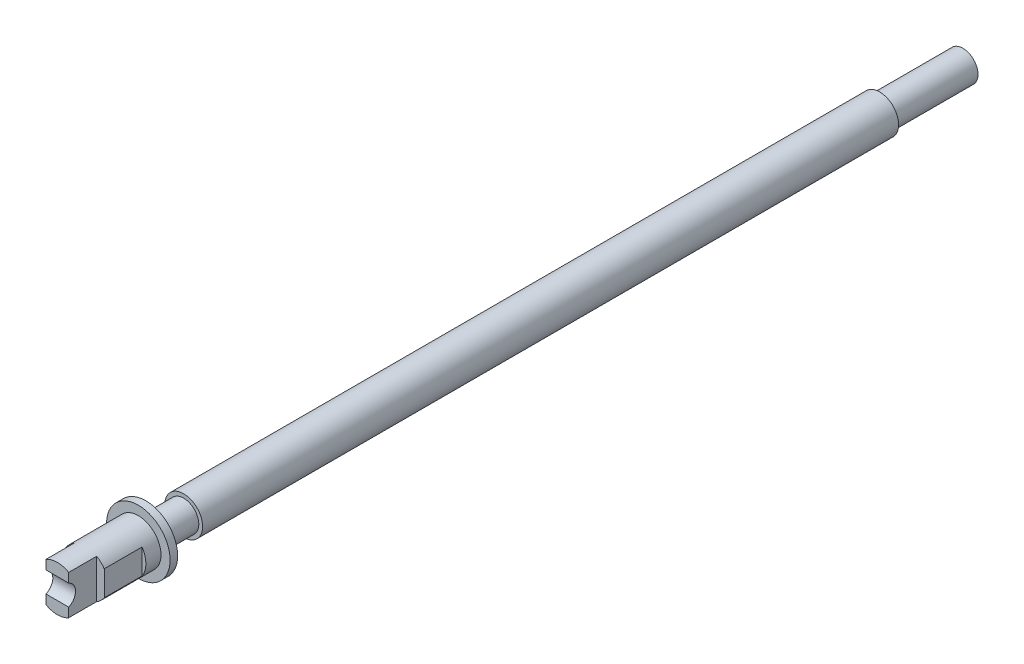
ISO-10303-21;
HEADER;
FILE_DESCRIPTION(('STEP AP214'),'2;1');
FILE_NAME('part.step','',(''),(''),'','','');
FILE_SCHEMA(('AUTOMOTIVE_DESIGN { 1 0 10303 214 1 1 1 1 }'));
ENDSEC;
DATA;
#1=APPLICATION_CONTEXT('core data for automotive mechanical design processes');
#2=APPLICATION_PROTOCOL_DEFINITION('international standard','automotive_design',2000,#1);
#3=PRODUCT_CONTEXT('',#1,'mechanical');
#4=PRODUCT('Part','Part','',(#3));
#5=PRODUCT_RELATED_PRODUCT_CATEGORY('part','',(#4));
#6=PRODUCT_DEFINITION_FORMATION('','',#4);
#7=PRODUCT_DEFINITION_CONTEXT('part definition',#1,'design');
#8=PRODUCT_DEFINITION('design','',#6,#7);
#9=PRODUCT_DEFINITION_SHAPE('','',#8);
#10=(LENGTH_UNIT() NAMED_UNIT(*) SI_UNIT(.MILLI.,.METRE.));
#11=(NAMED_UNIT(*) PLANE_ANGLE_UNIT() SI_UNIT($,.RADIAN.));
#12=(NAMED_UNIT(*) SI_UNIT($,.STERADIAN.) SOLID_ANGLE_UNIT());
#13=UNCERTAINTY_MEASURE_WITH_UNIT(LENGTH_MEASURE(1.E-05),#10,'distance_accuracy_value','');
#14=(GEOMETRIC_REPRESENTATION_CONTEXT(3) GLOBAL_UNCERTAINTY_ASSIGNED_CONTEXT((#13)) GLOBAL_UNIT_ASSIGNED_CONTEXT((#10,
#11,#12)) REPRESENTATION_CONTEXT('',''));
#15=CARTESIAN_POINT('',(0.,0.,0.));
#16=DIRECTION('',(0.,0.,1.));
#17=DIRECTION('',(1.,0.,0.));
#18=AXIS2_PLACEMENT_3D('',#15,#16,#17);
#19=CARTESIAN_POINT('',(0.,0.,143.7));
#20=DIRECTION('',(0.,0.,1.));
#21=DIRECTION('',(1.,0.,0.));
#22=AXIS2_PLACEMENT_3D('',#19,#20,#21);
#23=PLANE('',#22);
#24=DIRECTION('',(1.,0.,0.));
#25=VECTOR('',#24,1.);
#26=CARTESIAN_POINT('',(-7.5,-1.37477270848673,143.7));
#27=LINE('',#26,#25);
#28=CARTESIAN_POINT('',(-1.5,-1.37477270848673,143.7));
#29=VERTEX_POINT('',#28);
#30=CARTESIAN_POINT('',(1.5,-1.37477270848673,143.7));
#31=VERTEX_POINT('',#30);
#32=EDGE_CURVE('E57',#29,#31,#27,.T.);
#33=ORIENTED_EDGE('',*,*,#32,.F.);
#34=DIRECTION('',(0.,-1.,0.));
#35=VECTOR('',#34,1.);
#36=CARTESIAN_POINT('',(-1.5,0.,143.7));
#37=LINE('',#36,#35);
#38=CARTESIAN_POINT('',(-1.5,-2.59807621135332,143.7));
#39=VERTEX_POINT('',#38);
#40=EDGE_CURVE('E137',#29,#39,#37,.T.);
#41=ORIENTED_EDGE('',*,*,#40,.T.);
#42=CARTESIAN_POINT('',(0.,0.,143.7));
#43=DIRECTION('',(0.,0.,1.));
#44=DIRECTION('',(1.,0.,0.));
#45=AXIS2_PLACEMENT_3D('',#42,#43,#44);
#46=CIRCLE('',#45,3.);
#47=CARTESIAN_POINT('',(1.5,-2.59807621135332,143.7));
#48=VERTEX_POINT('',#47);
#49=EDGE_CURVE('E166',#39,#48,#46,.T.);
#50=ORIENTED_EDGE('',*,*,#49,.T.);
#51=DIRECTION('',(0.,-1.,0.));
#52=VECTOR('',#51,1.);
#53=CARTESIAN_POINT('',(1.5,0.,143.7));
#54=LINE('',#53,#52);
#55=EDGE_CURVE('E124',#31,#48,#54,.T.);
#56=ORIENTED_EDGE('',*,*,#55,.F.);
#57=EDGE_LOOP('',(#33,#41,#50,#56));
#58=FACE_BOUND('',#57,.T.);
#59=ADVANCED_FACE('F42',(#58),#23,.T.);
#60=CARTESIAN_POINT('',(0.,0.,35.));
#61=DIRECTION('',(0.,0.,-1.));
#62=DIRECTION('',(-1.,0.,0.));
#63=AXIS2_PLACEMENT_3D('',#60,#61,#62);
#64=CYLINDRICAL_SURFACE('',#63,2.);
#65=CARTESIAN_POINT('',(0.,0.,35.));
#66=DIRECTION('',(0.,0.,1.));
#67=DIRECTION('',(1.,0.,0.));
#68=AXIS2_PLACEMENT_3D('',#65,#66,#67);
#69=CIRCLE('',#68,2.);
#70=CARTESIAN_POINT('',(2.,0.,35.));
#71=VERTEX_POINT('',#70);
#72=EDGE_CURVE('E50',#71,#71,#69,.T.);
#73=ORIENTED_EDGE('',*,*,#72,.F.);
#74=EDGE_LOOP('',(#73));
#75=FACE_BOUND('',#74,.T.);
#76=CARTESIAN_POINT('',(0.,0.,24.));
#77=DIRECTION('',(0.,0.,-1.));
#78=DIRECTION('',(-1.,0.,0.));
#79=AXIS2_PLACEMENT_3D('',#76,#77,#78);
#80=CIRCLE('',#79,2.);
#81=CARTESIAN_POINT('',(-2.,0.,24.));
#82=VERTEX_POINT('',#81);
#83=EDGE_CURVE('E129',#82,#82,#80,.T.);
#84=ORIENTED_EDGE('',*,*,#83,.F.);
#85=EDGE_LOOP('',(#84));
#86=FACE_BOUND('',#85,.T.);
#87=ADVANCED_FACE('F44',(#75,#86),#64,.T.);
#88=CARTESIAN_POINT('',(2.5,0.,129.64589803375));
#89=DIRECTION('',(1.,0.,0.));
#90=DIRECTION('',(0.,0.,-1.));
#91=AXIS2_PLACEMENT_3D('',#88,#89,#90);
#92=PLANE('',#91);
#93=DIRECTION('',(0.,0.,1.));
#94=VECTOR('',#93,1.);
#95=CARTESIAN_POINT('',(2.5,1.6583123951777,129.64589803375));
#96=LINE('',#95,#94);
#97=CARTESIAN_POINT('',(2.5,1.6583123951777,135.));
#98=VERTEX_POINT('',#97);
#99=CARTESIAN_POINT('',(2.5,1.6583123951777,140.));
#100=VERTEX_POINT('',#99);
#101=EDGE_CURVE('E155',#98,#100,#96,.T.);
#102=ORIENTED_EDGE('',*,*,#101,.T.);
#103=DIRECTION('',(0.,1.,0.));
#104=VECTOR('',#103,1.);
#105=CARTESIAN_POINT('',(2.5,0.,140.));
#106=LINE('',#105,#104);
#107=CARTESIAN_POINT('',(2.5,-1.6583123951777,140.));
#108=VERTEX_POINT('',#107);
#109=EDGE_CURVE('E132',#108,#100,#106,.T.);
#110=ORIENTED_EDGE('',*,*,#109,.F.);
#111=DIRECTION('',(0.,0.,1.));
#112=VECTOR('',#111,1.);
#113=CARTESIAN_POINT('',(2.5,-1.6583123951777,129.64589803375));
#114=LINE('',#113,#112);
#115=CARTESIAN_POINT('',(2.5,-1.6583123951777,135.));
#116=VERTEX_POINT('',#115);
#117=EDGE_CURVE('E149',#116,#108,#114,.T.);
#118=ORIENTED_EDGE('',*,*,#117,.F.);
#119=DIRECTION('',(0.,-1.,0.));
#120=VECTOR('',#119,1.);
#121=CARTESIAN_POINT('',(2.5,0.,135.));
#122=LINE('',#121,#120);
#123=EDGE_CURVE('E152',#98,#116,#122,.T.);
#124=ORIENTED_EDGE('',*,*,#123,.F.);
#125=EDGE_LOOP('',(#102,#110,#118,#124));
#126=FACE_BOUND('',#125,.T.);
#127=ADVANCED_FACE('F200',(#126),#92,.T.);
#128=CARTESIAN_POINT('',(0.,0.,143.7));
#129=DIRECTION('',(0.,0.,-1.));
#130=DIRECTION('',(-1.,0.,0.));
#131=AXIS2_PLACEMENT_3D('',#128,#129,#130);
#132=CYLINDRICAL_SURFACE('',#131,3.);
#133=CARTESIAN_POINT('',(0.,0.,133.));
#134=DIRECTION('',(0.,0.,1.));
#135=DIRECTION('',(1.,0.,0.));
#136=AXIS2_PLACEMENT_3D('',#133,#134,#135);
#137=CIRCLE('',#136,3.);
#138=CARTESIAN_POINT('',(3.,0.,133.));
#139=VERTEX_POINT('',#138);
#140=EDGE_CURVE('E162',#139,#139,#137,.T.);
#141=ORIENTED_EDGE('',*,*,#140,.T.);
#142=EDGE_LOOP('',(#141));
#143=FACE_BOUND('',#142,.T.);
#144=CARTESIAN_POINT('',(1.5,2.59807621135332,143.7));
#145=VERTEX_POINT('',#144);
#146=CARTESIAN_POINT('',(-1.5,2.59807621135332,143.7));
#147=VERTEX_POINT('',#146);
#148=EDGE_CURVE('E163',#145,#147,#46,.T.);
#149=ORIENTED_EDGE('',*,*,#148,.F.);
#150=DIRECTION('',(0.,0.,1.));
#151=VECTOR('',#150,1.);
#152=CARTESIAN_POINT('',(1.5,2.59807621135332,140.));
#153=LINE('',#152,#151);
#154=CARTESIAN_POINT('',(1.5,2.59807621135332,140.));
#155=VERTEX_POINT('',#154);
#156=EDGE_CURVE('E122',#155,#145,#153,.T.);
#157=ORIENTED_EDGE('',*,*,#156,.F.);
#158=CARTESIAN_POINT('',(0.,0.,140.));
#159=DIRECTION('',(0.,0.,1.));
#160=DIRECTION('',(1.,0.,0.));
#161=AXIS2_PLACEMENT_3D('',#158,#159,#160);
#162=CIRCLE('',#161,3.);
#163=EDGE_CURVE('E123',#100,#155,#162,.T.);
#164=ORIENTED_EDGE('',*,*,#163,.F.);
#165=ORIENTED_EDGE('',*,*,#101,.F.);
#166=CARTESIAN_POINT('',(0.,0.,135.));
#167=DIRECTION('',(0.,0.,1.));
#168=DIRECTION('',(1.,0.,0.));
#169=AXIS2_PLACEMENT_3D('',#166,#167,#168);
#170=CIRCLE('',#169,3.);
#171=EDGE_CURVE('E154',#98,#116,#170,.F.);
#172=ORIENTED_EDGE('',*,*,#171,.T.);
#173=ORIENTED_EDGE('',*,*,#117,.T.);
#174=CARTESIAN_POINT('',(1.5,-2.59807621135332,140.));
#175=VERTEX_POINT('',#174);
#176=EDGE_CURVE('E64',#175,#108,#162,.T.);
#177=ORIENTED_EDGE('',*,*,#176,.F.);
#178=DIRECTION('',(0.,0.,1.));
#179=VECTOR('',#178,1.);
#180=CARTESIAN_POINT('',(1.5,-2.59807621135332,140.));
#181=LINE('',#180,#179);
#182=EDGE_CURVE('E134',#175,#48,#181,.T.);
#183=ORIENTED_EDGE('',*,*,#182,.T.);
#184=ORIENTED_EDGE('',*,*,#49,.F.);
#185=DIRECTION('',(0.,0.,1.));
#186=VECTOR('',#185,1.);
#187=CARTESIAN_POINT('',(-1.5,-2.59807621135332,140.));
#188=LINE('',#187,#186);
#189=CARTESIAN_POINT('',(-1.5,-2.59807621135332,140.));
#190=VERTEX_POINT('',#189);
#191=EDGE_CURVE('E146',#190,#39,#188,.T.);
#192=ORIENTED_EDGE('',*,*,#191,.F.);
#193=CARTESIAN_POINT('',(0.,0.,140.));
#194=DIRECTION('',(0.,0.,1.));
#195=DIRECTION('',(1.,0.,0.));
#196=AXIS2_PLACEMENT_3D('',#193,#194,#195);
#197=CIRCLE('',#196,3.);
#198=CARTESIAN_POINT('',(-1.5,2.59807621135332,140.));
#199=VERTEX_POINT('',#198);
#200=EDGE_CURVE('E141',#199,#190,#197,.T.);
#201=ORIENTED_EDGE('',*,*,#200,.F.);
#202=DIRECTION('',(0.,0.,1.));
#203=VECTOR('',#202,1.);
#204=CARTESIAN_POINT('',(-1.5,2.59807621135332,140.));
#205=LINE('',#204,#203);
#206=EDGE_CURVE('E144',#199,#147,#205,.T.);
#207=ORIENTED_EDGE('',*,*,#206,.T.);
#208=EDGE_LOOP('',(#149,#157,#164,#165,#172,#173,#177,#183,#184,#192,#201,#207));
#209=FACE_BOUND('',#208,.T.);
#210=ADVANCED_FACE('F199',(#143,#209),#132,.T.);
#211=DIRECTION('',(1.,0.,0.));
#212=VECTOR('',#211,1.);
#213=CARTESIAN_POINT('',(-7.5,1.37477270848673,143.7));
#214=LINE('',#213,#212);
#215=CARTESIAN_POINT('',(1.5,1.37477270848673,143.7));
#216=VERTEX_POINT('',#215);
#217=CARTESIAN_POINT('',(-1.5,1.37477270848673,143.7));
#218=VERTEX_POINT('',#217);
#219=EDGE_CURVE('E106',#216,#218,#214,.F.);
#220=ORIENTED_EDGE('',*,*,#219,.F.);
#221=EDGE_CURVE('E115',#145,#216,#54,.T.);
#222=ORIENTED_EDGE('',*,*,#221,.F.);
#223=ORIENTED_EDGE('',*,*,#148,.T.);
#224=EDGE_CURVE('E118',#147,#218,#37,.T.);
#225=ORIENTED_EDGE('',*,*,#224,.T.);
#226=EDGE_LOOP('',(#220,#222,#223,#225));
#227=FACE_BOUND('',#226,.T.);
#228=ADVANCED_FACE('F114',(#227),#23,.T.);
#229=CARTESIAN_POINT('',(0.,0.,133.));
#230=DIRECTION('',(0.,0.,1.));
#231=DIRECTION('',(1.,0.,0.));
#232=AXIS2_PLACEMENT_3D('',#229,#230,#231);
#233=PLANE('',#232);
#234=CARTESIAN_POINT('',(0.,0.,133.));
#235=DIRECTION('',(0.,0.,1.));
#236=DIRECTION('',(1.,0.,0.));
#237=AXIS2_PLACEMENT_3D('',#234,#235,#236);
#238=CIRCLE('',#237,4.2);
#239=CARTESIAN_POINT('',(4.2,0.,133.));
#240=VERTEX_POINT('',#239);
#241=EDGE_CURVE('E169',#240,#240,#238,.T.);
#242=ORIENTED_EDGE('',*,*,#241,.T.);
#243=EDGE_LOOP('',(#242));
#244=FACE_BOUND('',#243,.T.);
#245=ORIENTED_EDGE('',*,*,#140,.F.);
#246=EDGE_LOOP('',(#245));
#247=FACE_BOUND('',#246,.T.);
#248=ADVANCED_FACE('F232',(#244,#247),#233,.T.);
#249=CARTESIAN_POINT('',(0.,0.,127.));
#250=DIRECTION('',(0.,0.,1.));
#251=DIRECTION('',(1.,0.,0.));
#252=AXIS2_PLACEMENT_3D('',#249,#250,#251);
#253=PLANE('',#252);
#254=CARTESIAN_POINT('',(0.,0.,127.));
#255=DIRECTION('',(0.,0.,1.));
#256=DIRECTION('',(1.,0.,0.));
#257=AXIS2_PLACEMENT_3D('',#254,#255,#256);
#258=CIRCLE('',#257,2.5);
#259=CARTESIAN_POINT('',(2.5,0.,127.));
#260=VERTEX_POINT('',#259);
#261=EDGE_CURVE('E181',#260,#260,#258,.T.);
#262=ORIENTED_EDGE('',*,*,#261,.T.);
#263=EDGE_LOOP('',(#262));
#264=FACE_BOUND('',#263,.T.);
#265=CARTESIAN_POINT('',(0.,0.,127.));
#266=DIRECTION('',(0.,0.,1.));
#267=DIRECTION('',(1.,0.,0.));
#268=AXIS2_PLACEMENT_3D('',#265,#266,#267);
#269=CIRCLE('',#268,2.);
#270=CARTESIAN_POINT('',(2.,0.,127.));
#271=VERTEX_POINT('',#270);
#272=EDGE_CURVE('E172',#271,#271,#269,.T.);
#273=ORIENTED_EDGE('',*,*,#272,.F.);
#274=EDGE_LOOP('',(#273));
#275=FACE_BOUND('',#274,.T.);
#276=ADVANCED_FACE('F237',(#264,#275),#253,.T.);
#277=CARTESIAN_POINT('',(0.,0.,35.));
#278=DIRECTION('',(0.,0.,1.));
#279=DIRECTION('',(1.,0.,0.));
#280=AXIS2_PLACEMENT_3D('',#277,#278,#279);
#281=PLANE('',#280);
#282=CARTESIAN_POINT('',(0.,0.,35.));
#283=DIRECTION('',(0.,0.,1.));
#284=DIRECTION('',(1.,0.,0.));
#285=AXIS2_PLACEMENT_3D('',#282,#283,#284);
#286=CIRCLE('',#285,2.5);
#287=CARTESIAN_POINT('',(2.5,0.,35.));
#288=VERTEX_POINT('',#287);
#289=EDGE_CURVE('E178',#288,#288,#286,.T.);
#290=ORIENTED_EDGE('',*,*,#289,.F.);
#291=EDGE_LOOP('',(#290));
#292=FACE_BOUND('',#291,.T.);
#293=ORIENTED_EDGE('',*,*,#72,.T.);
#294=EDGE_LOOP('',(#293));
#295=FACE_BOUND('',#294,.T.);
#296=ADVANCED_FACE('F260',(#292,#295),#281,.F.);
#297=CARTESIAN_POINT('',(0.,0.,127.));
#298=DIRECTION('',(0.,0.,-1.));
#299=DIRECTION('',(-1.,0.,0.));
#300=AXIS2_PLACEMENT_3D('',#297,#298,#299);
#301=CYLINDRICAL_SURFACE('',#300,2.5);
#302=ORIENTED_EDGE('',*,*,#261,.F.);
#303=EDGE_LOOP('',(#302));
#304=FACE_BOUND('',#303,.T.);
#305=ORIENTED_EDGE('',*,*,#289,.T.);
#306=EDGE_LOOP('',(#305));
#307=FACE_BOUND('',#306,.T.);
#308=ADVANCED_FACE('F256',(#304,#307),#301,.T.);
#309=CARTESIAN_POINT('',(0.,0.,132.));
#310=DIRECTION('',(0.,0.,-1.));
#311=DIRECTION('',(-1.,0.,0.));
#312=AXIS2_PLACEMENT_3D('',#309,#310,#311);
#313=CYLINDRICAL_SURFACE('',#312,2.);
#314=CARTESIAN_POINT('',(0.,0.,132.));
#315=DIRECTION('',(0.,0.,1.));
#316=DIRECTION('',(1.,0.,0.));
#317=AXIS2_PLACEMENT_3D('',#314,#315,#316);
#318=CIRCLE('',#317,2.);
#319=CARTESIAN_POINT('',(2.,0.,132.));
#320=VERTEX_POINT('',#319);
#321=EDGE_CURVE('E175',#320,#320,#318,.T.);
#322=ORIENTED_EDGE('',*,*,#321,.F.);
#323=EDGE_LOOP('',(#322));
#324=FACE_BOUND('',#323,.T.);
#325=ORIENTED_EDGE('',*,*,#272,.T.);
#326=EDGE_LOOP('',(#325));
#327=FACE_BOUND('',#326,.T.);
#328=ADVANCED_FACE('F249',(#324,#327),#313,.T.);
#329=CARTESIAN_POINT('',(0.,0.,132.));
#330=DIRECTION('',(0.,0.,1.));
#331=DIRECTION('',(1.,0.,0.));
#332=AXIS2_PLACEMENT_3D('',#329,#330,#331);
#333=PLANE('',#332);
#334=CARTESIAN_POINT('',(0.,0.,132.));
#335=DIRECTION('',(0.,0.,1.));
#336=DIRECTION('',(1.,0.,0.));
#337=AXIS2_PLACEMENT_3D('',#334,#335,#336);
#338=CIRCLE('',#337,4.2);
#339=CARTESIAN_POINT('',(4.2,0.,132.));
#340=VERTEX_POINT('',#339);
#341=EDGE_CURVE('E165',#340,#340,#338,.T.);
#342=ORIENTED_EDGE('',*,*,#341,.F.);
#343=EDGE_LOOP('',(#342));
#344=FACE_BOUND('',#343,.T.);
#345=ORIENTED_EDGE('',*,*,#321,.T.);
#346=EDGE_LOOP('',(#345));
#347=FACE_BOUND('',#346,.T.);
#348=ADVANCED_FACE('F245',(#344,#347),#333,.F.);
#349=CARTESIAN_POINT('',(0.,0.,133.));
#350=DIRECTION('',(0.,0.,-1.));
#351=DIRECTION('',(-1.,0.,0.));
#352=AXIS2_PLACEMENT_3D('',#349,#350,#351);
#353=CYLINDRICAL_SURFACE('',#352,4.2);
#354=ORIENTED_EDGE('',*,*,#241,.F.);
#355=EDGE_LOOP('',(#354));
#356=FACE_BOUND('',#355,.T.);
#357=ORIENTED_EDGE('',*,*,#341,.T.);
#358=EDGE_LOOP('',(#357));
#359=FACE_BOUND('',#358,.T.);
#360=ADVANCED_FACE('F248',(#356,#359),#353,.T.);
#361=CARTESIAN_POINT('',(0.,0.,135.));
#362=DIRECTION('',(0.,0.,1.));
#363=DIRECTION('',(1.,0.,0.));
#364=AXIS2_PLACEMENT_3D('',#361,#362,#363);
#365=PLANE('',#364);
#366=ORIENTED_EDGE('',*,*,#171,.F.);
#367=ORIENTED_EDGE('',*,*,#123,.T.);
#368=EDGE_LOOP('',(#366,#367));
#369=FACE_BOUND('',#368,.T.);
#370=ADVANCED_FACE('F203',(#369),#365,.T.);
#371=CARTESIAN_POINT('',(-1.5,0.,140.));
#372=DIRECTION('',(-1.,0.,0.));
#373=DIRECTION('',(0.,-1.,0.));
#374=AXIS2_PLACEMENT_3D('',#371,#372,#373);
#375=PLANE('',#374);
#376=CARTESIAN_POINT('',(-1.5,0.,144.3));
#377=DIRECTION('',(-1.,0.,0.));
#378=DIRECTION('',(0.,-1.,0.));
#379=AXIS2_PLACEMENT_3D('',#376,#377,#378);
#380=CIRCLE('',#379,1.5);
#381=EDGE_CURVE('E188',#218,#29,#380,.T.);
#382=ORIENTED_EDGE('',*,*,#381,.F.);
#383=ORIENTED_EDGE('',*,*,#224,.F.);
#384=ORIENTED_EDGE('',*,*,#206,.F.);
#385=DIRECTION('',(0.,-1.,0.));
#386=VECTOR('',#385,1.);
#387=CARTESIAN_POINT('',(-1.5,0.,140.));
#388=LINE('',#387,#386);
#389=EDGE_CURVE('E139',#199,#190,#388,.T.);
#390=ORIENTED_EDGE('',*,*,#389,.T.);
#391=ORIENTED_EDGE('',*,*,#191,.T.);
#392=ORIENTED_EDGE('',*,*,#40,.F.);
#393=EDGE_LOOP('',(#382,#383,#384,#390,#391,#392));
#394=FACE_BOUND('',#393,.T.);
#395=ADVANCED_FACE('F210',(#394),#375,.T.);
#396=CARTESIAN_POINT('',(0.,0.,140.));
#397=DIRECTION('',(0.,0.,1.));
#398=DIRECTION('',(1.,0.,0.));
#399=AXIS2_PLACEMENT_3D('',#396,#397,#398);
#400=PLANE('',#399);
#401=ORIENTED_EDGE('',*,*,#389,.F.);
#402=ORIENTED_EDGE('',*,*,#200,.T.);
#403=EDGE_LOOP('',(#401,#402));
#404=FACE_BOUND('',#403,.T.);
#405=ADVANCED_FACE('F214',(#404),#400,.T.);
#406=CARTESIAN_POINT('',(1.5,0.,140.));
#407=DIRECTION('',(-1.,0.,0.));
#408=DIRECTION('',(0.,-1.,0.));
#409=AXIS2_PLACEMENT_3D('',#406,#407,#408);
#410=PLANE('',#409);
#411=ORIENTED_EDGE('',*,*,#221,.T.);
#412=CARTESIAN_POINT('',(1.5,0.,144.3));
#413=DIRECTION('',(-1.,0.,0.));
#414=DIRECTION('',(0.,-1.,0.));
#415=AXIS2_PLACEMENT_3D('',#412,#413,#414);
#416=CIRCLE('',#415,1.5);
#417=EDGE_CURVE('E14',#216,#31,#416,.T.);
#418=ORIENTED_EDGE('',*,*,#417,.T.);
#419=ORIENTED_EDGE('',*,*,#55,.T.);
#420=ORIENTED_EDGE('',*,*,#182,.F.);
#421=DIRECTION('',(0.,-1.,0.));
#422=VECTOR('',#421,1.);
#423=CARTESIAN_POINT('',(1.5,0.,140.));
#424=LINE('',#423,#422);
#425=EDGE_CURVE('E127',#155,#175,#424,.T.);
#426=ORIENTED_EDGE('',*,*,#425,.F.);
#427=ORIENTED_EDGE('',*,*,#156,.T.);
#428=EDGE_LOOP('',(#411,#418,#419,#420,#426,#427));
#429=FACE_BOUND('',#428,.T.);
#430=ADVANCED_FACE('F120',(#429),#410,.F.);
#431=CARTESIAN_POINT('',(0.,0.,140.));
#432=DIRECTION('',(0.,0.,1.));
#433=DIRECTION('',(1.,0.,0.));
#434=AXIS2_PLACEMENT_3D('',#431,#432,#433);
#435=PLANE('',#434);
#436=ORIENTED_EDGE('',*,*,#163,.T.);
#437=ORIENTED_EDGE('',*,*,#425,.T.);
#438=ORIENTED_EDGE('',*,*,#176,.T.);
#439=ORIENTED_EDGE('',*,*,#109,.T.);
#440=EDGE_LOOP('',(#436,#437,#438,#439));
#441=FACE_BOUND('',#440,.T.);
#442=ADVANCED_FACE('F194',(#441),#435,.T.);
#443=CARTESIAN_POINT('',(0.,0.,24.));
#444=DIRECTION('',(0.,0.,-1.));
#445=DIRECTION('',(-1.,0.,0.));
#446=AXIS2_PLACEMENT_3D('',#443,#444,#445);
#447=PLANE('',#446);
#448=ORIENTED_EDGE('',*,*,#83,.T.);
#449=EDGE_LOOP('',(#448));
#450=FACE_BOUND('',#449,.T.);
#451=ADVANCED_FACE('F326',(#450),#447,.T.);
#452=CARTESIAN_POINT('',(-7.5,0.,144.3));
#453=DIRECTION('',(1.,0.,0.));
#454=DIRECTION('',(0.,0.,-1.));
#455=AXIS2_PLACEMENT_3D('',#452,#453,#454);
#456=CYLINDRICAL_SURFACE('',#455,1.5);
#457=ORIENTED_EDGE('',*,*,#381,.T.);
#458=ORIENTED_EDGE('',*,*,#32,.T.);
#459=ORIENTED_EDGE('',*,*,#417,.F.);
#460=ORIENTED_EDGE('',*,*,#219,.T.);
#461=EDGE_LOOP('',(#457,#458,#459,#460));
#462=FACE_BOUND('',#461,.T.);
#463=ADVANCED_FACE('F105',(#462),#456,.F.);
#464=CLOSED_SHELL('',(#59,#87,#127,#210,#228,#248,#276,#296,#308,#328,#348,#360,#370,#395,#405,
#430,#442,#451,#463));
#465=MANIFOLD_SOLID_BREP('B2',#464);
#466=ADVANCED_BREP_SHAPE_REPRESENTATION('',(#18,#465),#14);
#467=SHAPE_DEFINITION_REPRESENTATION(#9,#466);
ENDSEC;
END-ISO-10303-21;
